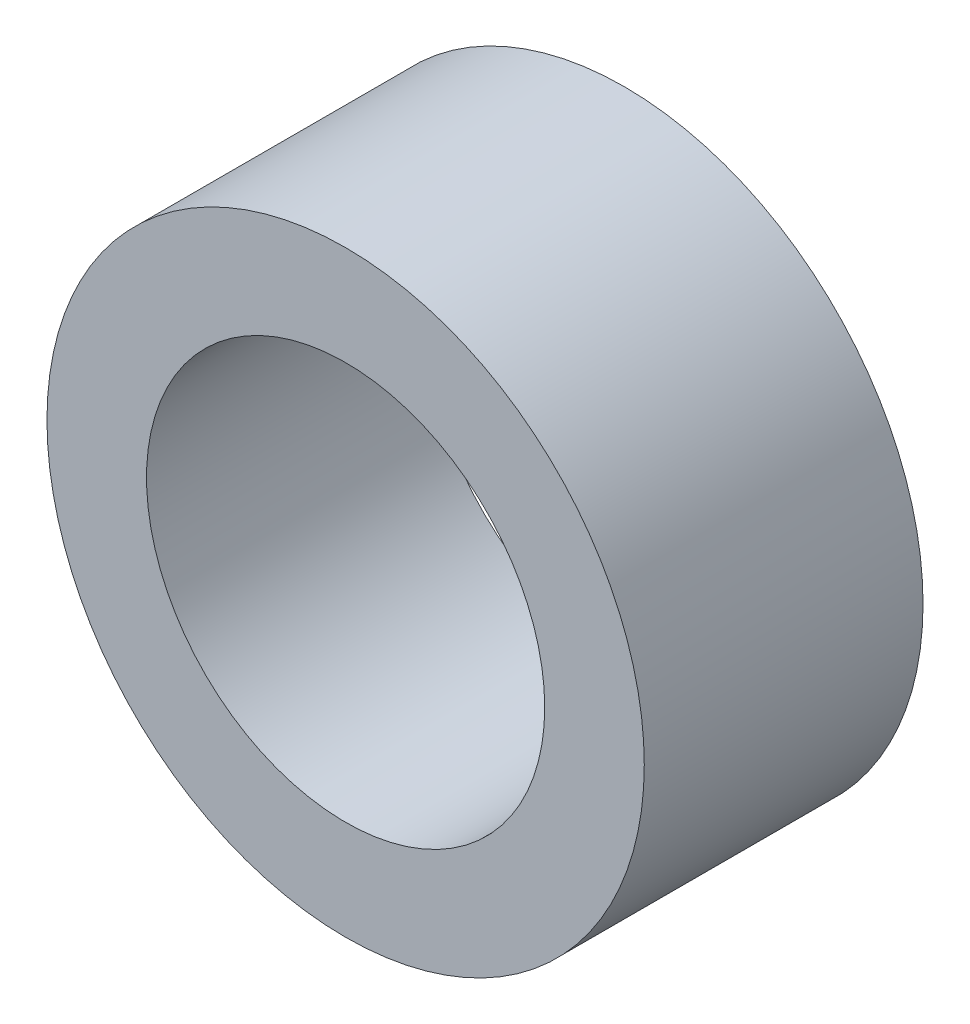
from build123d import *

# Parameters (mm, degrees)
SKETCH1_R           = 30
SKETCH1_R_2         = 20
BOSS_EXTRUDE1_DEPTH = 14


with BuildPart() as part:
    # Sketch1 → Boss-Extrude1 (new, symmetric)
    with BuildSketch(Plane.XY):
        Circle(SKETCH1_R)
        Circle(SKETCH1_R_2, mode=Mode.SUBTRACT)
    extrude(amount=BOSS_EXTRUDE1_DEPTH, both=True)


solid = part.part
